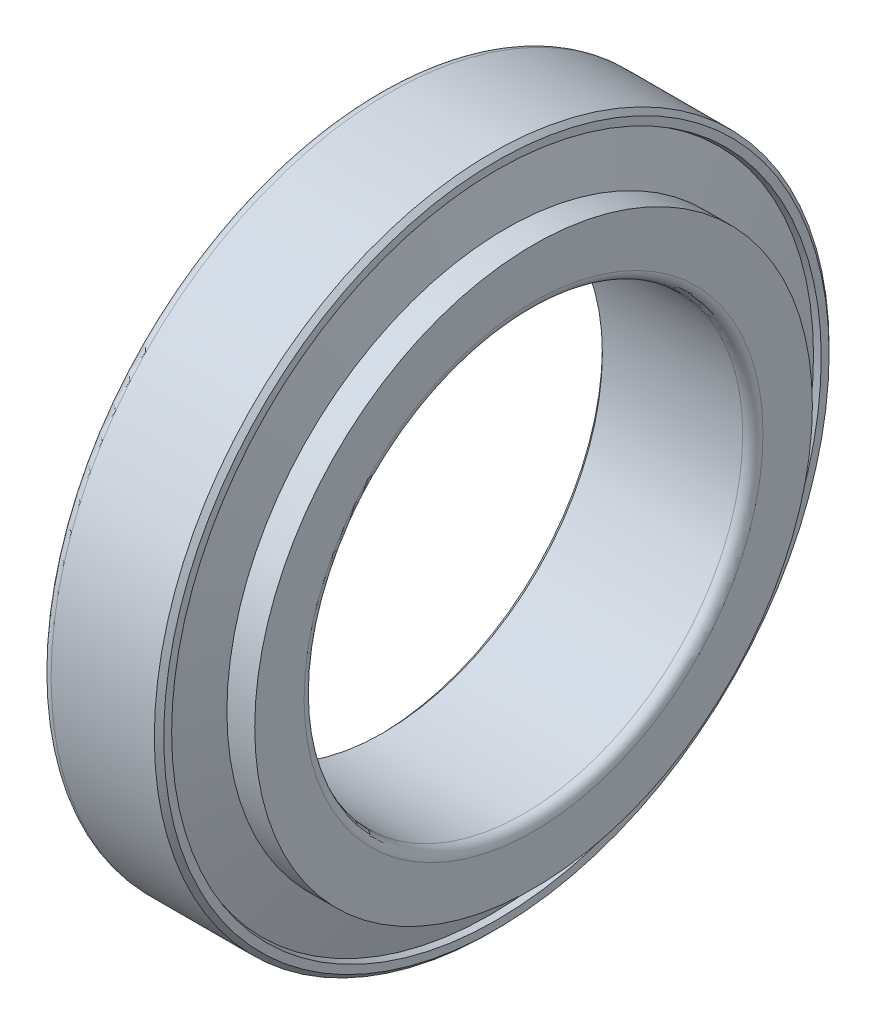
ISO-10303-21;
HEADER;
FILE_DESCRIPTION(('STEP AP214'),'2;1');
FILE_NAME('part.step','',(''),(''),'','','');
FILE_SCHEMA(('AUTOMOTIVE_DESIGN { 1 0 10303 214 1 1 1 1 }'));
ENDSEC;
DATA;
#1=APPLICATION_CONTEXT('core data for automotive mechanical design processes');
#2=APPLICATION_PROTOCOL_DEFINITION('international standard','automotive_design',2000,#1);
#3=PRODUCT_CONTEXT('',#1,'mechanical');
#4=PRODUCT('Part','Part','',(#3));
#5=PRODUCT_RELATED_PRODUCT_CATEGORY('part','',(#4));
#6=PRODUCT_DEFINITION_FORMATION('','',#4);
#7=PRODUCT_DEFINITION_CONTEXT('part definition',#1,'design');
#8=PRODUCT_DEFINITION('design','',#6,#7);
#9=PRODUCT_DEFINITION_SHAPE('','',#8);
#10=(LENGTH_UNIT() NAMED_UNIT(*) SI_UNIT(.MILLI.,.METRE.));
#11=(NAMED_UNIT(*) PLANE_ANGLE_UNIT() SI_UNIT($,.RADIAN.));
#12=(NAMED_UNIT(*) SI_UNIT($,.STERADIAN.) SOLID_ANGLE_UNIT());
#13=UNCERTAINTY_MEASURE_WITH_UNIT(LENGTH_MEASURE(1.E-05),#10,'distance_accuracy_value','');
#14=(GEOMETRIC_REPRESENTATION_CONTEXT(3) GLOBAL_UNCERTAINTY_ASSIGNED_CONTEXT((#13)) GLOBAL_UNIT_ASSIGNED_CONTEXT((#10,
#11,#12)) REPRESENTATION_CONTEXT('',''));
#15=CARTESIAN_POINT('',(0.,0.,0.));
#16=DIRECTION('',(0.,0.,1.));
#17=DIRECTION('',(1.,0.,0.));
#18=AXIS2_PLACEMENT_3D('',#15,#16,#17);
#19=CARTESIAN_POINT('',(-23.,0.,0.));
#20=DIRECTION('',(1.,0.,0.));
#21=DIRECTION('',(0.,0.,-1.));
#22=AXIS2_PLACEMENT_3D('',#19,#20,#21);
#23=CONICAL_SURFACE('',#22,42.7835,0.296705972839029);
#24=CARTESIAN_POINT('',(-21.4395483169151,0.,0.));
#25=DIRECTION('',(-1.,0.,0.));
#26=DIRECTION('',(0.,0.,1.));
#27=AXIS2_PLACEMENT_3D('',#24,#25,#26);
#28=CIRCLE('',#27,43.2605779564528);
#29=CARTESIAN_POINT('',(-21.4395483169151,0.,43.2605779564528));
#30=VERTEX_POINT('',#29);
#31=EDGE_CURVE('E42',#30,#30,#28,.T.);
#32=ORIENTED_EDGE('',*,*,#31,.F.);
#33=EDGE_LOOP('',(#32));
#34=FACE_BOUND('',#33,.T.);
#35=CARTESIAN_POINT('',(-23.,0.,0.));
#36=DIRECTION('',(1.,0.,0.));
#37=DIRECTION('',(0.,0.,-1.));
#38=AXIS2_PLACEMENT_3D('',#35,#36,#37);
#39=CIRCLE('',#38,42.7835);
#40=CARTESIAN_POINT('',(-23.,0.,-42.7835));
#41=VERTEX_POINT('',#40);
#42=EDGE_CURVE('E54',#41,#41,#39,.T.);
#43=ORIENTED_EDGE('',*,*,#42,.F.);
#44=EDGE_LOOP('',(#43));
#45=FACE_BOUND('',#44,.T.);
#46=ADVANCED_FACE('F31',(#34,#45),#23,.F.);
#47=CARTESIAN_POINT('',(-5.5,49.3,0.));
#48=DIRECTION('',(1.,0.,0.));
#49=DIRECTION('',(0.,0.,-1.));
#50=AXIS2_PLACEMENT_3D('',#47,#48,#49);
#51=PLANE('',#50);
#52=CARTESIAN_POINT('',(-5.5,0.,0.));
#53=DIRECTION('',(1.,0.,0.));
#54=DIRECTION('',(0.,0.,-1.));
#55=AXIS2_PLACEMENT_3D('',#52,#53,#54);
#56=CIRCLE('',#55,49.3);
#57=CARTESIAN_POINT('',(-5.5,0.,-49.3));
#58=VERTEX_POINT('',#57);
#59=EDGE_CURVE('E66',#58,#58,#56,.T.);
#60=ORIENTED_EDGE('',*,*,#59,.T.);
#61=EDGE_LOOP('',(#60));
#62=FACE_BOUND('',#61,.T.);
#63=CARTESIAN_POINT('',(-5.5,0.,0.));
#64=DIRECTION('',(1.,0.,0.));
#65=DIRECTION('',(0.,0.,-1.));
#66=AXIS2_PLACEMENT_3D('',#63,#64,#65);
#67=CIRCLE('',#66,48.1337869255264);
#68=CARTESIAN_POINT('',(-5.5,0.,-48.1337869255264));
#69=VERTEX_POINT('',#68);
#70=EDGE_CURVE('E51',#69,#69,#67,.T.);
#71=ORIENTED_EDGE('',*,*,#70,.F.);
#72=EDGE_LOOP('',(#71));
#73=FACE_BOUND('',#72,.T.);
#74=ADVANCED_FACE('F33',(#62,#73),#51,.T.);
#75=CARTESIAN_POINT('',(-6.37774841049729,0.,0.));
#76=DIRECTION('',(-1.,0.,0.));
#77=DIRECTION('',(0.,0.,1.));
#78=AXIS2_PLACEMENT_3D('',#75,#76,#77);
#79=CIRCLE('',#78,47.8654323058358);
#80=CARTESIAN_POINT('',(-6.37774841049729,0.,47.8654323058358));
#81=VERTEX_POINT('',#80);
#82=EDGE_CURVE('E46',#81,#81,#79,.F.);
#83=ORIENTED_EDGE('',*,*,#82,.F.);
#84=EDGE_LOOP('',(#83));
#85=FACE_BOUND('',#84,.T.);
#86=ORIENTED_EDGE('',*,*,#70,.T.);
#87=EDGE_LOOP('',(#86));
#88=FACE_BOUND('',#87,.T.);
#89=ADVANCED_FACE('F119',(#85,#88),#23,.F.);
#90=CARTESIAN_POINT('',(-23.,42.7835,0.));
#91=DIRECTION('',(-1.,0.,0.));
#92=DIRECTION('',(0.,0.,1.));
#93=AXIS2_PLACEMENT_3D('',#90,#91,#92);
#94=PLANE('',#93);
#95=ORIENTED_EDGE('',*,*,#42,.T.);
#96=EDGE_LOOP('',(#95));
#97=FACE_BOUND('',#96,.T.);
#98=CARTESIAN_POINT('',(-23.,0.,0.));
#99=DIRECTION('',(1.,0.,0.));
#100=DIRECTION('',(0.,0.,-1.));
#101=AXIS2_PLACEMENT_3D('',#98,#99,#100);
#102=CIRCLE('',#101,48.5);
#103=CARTESIAN_POINT('',(-23.,0.,-48.5));
#104=VERTEX_POINT('',#103);
#105=EDGE_CURVE('E57',#104,#104,#102,.T.);
#106=ORIENTED_EDGE('',*,*,#105,.F.);
#107=EDGE_LOOP('',(#106));
#108=FACE_BOUND('',#107,.T.);
#109=ADVANCED_FACE('F128',(#97,#108),#94,.T.);
#110=CARTESIAN_POINT('',(-21.5,0.,0.));
#111=DIRECTION('',(1.,0.,0.));
#112=DIRECTION('',(0.,0.,-1.));
#113=AXIS2_PLACEMENT_3D('',#110,#111,#112);
#114=TOROIDAL_SURFACE('',#113,48.5,1.5);
#115=ORIENTED_EDGE('',*,*,#105,.T.);
#116=EDGE_LOOP('',(#115));
#117=FACE_BOUND('',#116,.T.);
#118=CARTESIAN_POINT('',(-21.5,0.,0.));
#119=DIRECTION('',(1.,0.,0.));
#120=DIRECTION('',(0.,0.,-1.));
#121=AXIS2_PLACEMENT_3D('',#118,#119,#120);
#122=CIRCLE('',#121,50.);
#123=CARTESIAN_POINT('',(-21.5,0.,-50.));
#124=VERTEX_POINT('',#123);
#125=EDGE_CURVE('E60',#124,#124,#122,.T.);
#126=ORIENTED_EDGE('',*,*,#125,.F.);
#127=EDGE_LOOP('',(#126));
#128=FACE_BOUND('',#127,.T.);
#129=ADVANCED_FACE('F133',(#117,#128),#114,.T.);
#130=CARTESIAN_POINT('',(-42.5,0.,0.));
#131=DIRECTION('',(1.,0.,0.));
#132=DIRECTION('',(0.,0.,-1.));
#133=AXIS2_PLACEMENT_3D('',#130,#131,#132);
#134=CYLINDRICAL_SURFACE('',#133,50.);
#135=ORIENTED_EDGE('',*,*,#125,.T.);
#136=EDGE_LOOP('',(#135));
#137=FACE_BOUND('',#136,.T.);
#138=CARTESIAN_POINT('',(-6.2,0.,0.));
#139=DIRECTION('',(1.,0.,0.));
#140=DIRECTION('',(0.,0.,-1.));
#141=AXIS2_PLACEMENT_3D('',#138,#139,#140);
#142=CIRCLE('',#141,50.);
#143=CARTESIAN_POINT('',(-6.2,0.,-50.));
#144=VERTEX_POINT('',#143);
#145=EDGE_CURVE('E63',#144,#144,#142,.T.);
#146=ORIENTED_EDGE('',*,*,#145,.F.);
#147=EDGE_LOOP('',(#146));
#148=FACE_BOUND('',#147,.T.);
#149=ADVANCED_FACE('F155',(#137,#148),#134,.T.);
#150=CARTESIAN_POINT('',(-5.5,0.,0.));
#151=DIRECTION('',(-1.,0.,0.));
#152=DIRECTION('',(0.,0.,1.));
#153=AXIS2_PLACEMENT_3D('',#150,#151,#152);
#154=CONICAL_SURFACE('',#153,49.3,0.785398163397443);
#155=ORIENTED_EDGE('',*,*,#145,.T.);
#156=EDGE_LOOP('',(#155));
#157=FACE_BOUND('',#156,.T.);
#158=ORIENTED_EDGE('',*,*,#59,.F.);
#159=EDGE_LOOP('',(#158));
#160=FACE_BOUND('',#159,.T.);
#161=ADVANCED_FACE('F149',(#157,#160),#154,.T.);
#162=CARTESIAN_POINT('',(-21.5,0.,0.));
#163=DIRECTION('',(-1.,0.,0.));
#164=DIRECTION('',(0.,0.,1.));
#165=AXIS2_PLACEMENT_3D('',#162,#163,#164);
#166=CONICAL_SURFACE('',#165,43.4583065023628,1.27409035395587);
#167=CARTESIAN_POINT('',(-19.3179542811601,0.,0.));
#168=DIRECTION('',(-1.,0.,0.));
#169=DIRECTION('',(0.,0.,1.));
#170=AXIS2_PLACEMENT_3D('',#167,#168,#169);
#171=CIRCLE('',#170,36.3211565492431);
#172=CARTESIAN_POINT('',(-19.3179542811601,0.,36.3211565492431));
#173=VERTEX_POINT('',#172);
#174=EDGE_CURVE('E10',#173,#173,#171,.T.);
#175=ORIENTED_EDGE('',*,*,#174,.F.);
#176=EDGE_LOOP('',(#175));
#177=FACE_BOUND('',#176,.T.);
#178=ORIENTED_EDGE('',*,*,#31,.T.);
#179=EDGE_LOOP('',(#178));
#180=FACE_BOUND('',#179,.T.);
#181=ADVANCED_FACE('F143',(#177,#180),#166,.F.);
#182=CARTESIAN_POINT('',(-19.1975728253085,0.,0.));
#183=DIRECTION('',(1.,0.,0.));
#184=DIRECTION('',(0.,0.,-1.));
#185=AXIS2_PLACEMENT_3D('',#182,#183,#184);
#186=CONICAL_SURFACE('',#185,35.9274065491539,0.296705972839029);
#187=CARTESIAN_POINT('',(-19.1870447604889,0.,0.));
#188=DIRECTION('',(-1.,0.,0.));
#189=DIRECTION('',(0.,0.,1.));
#190=AXIS2_PLACEMENT_3D('',#187,#188,#189);
#191=CIRCLE('',#190,35.9306253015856);
#192=CARTESIAN_POINT('',(-19.1870447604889,0.,35.9306253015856));
#193=VERTEX_POINT('',#192);
#194=EDGE_CURVE('E38',#193,#193,#191,.F.);
#195=ORIENTED_EDGE('',*,*,#194,.F.);
#196=EDGE_LOOP('',(#195));
#197=FACE_BOUND('',#196,.T.);
#198=CARTESIAN_POINT('',(-4.13577291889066,0.,0.));
#199=DIRECTION('',(1.,0.,0.));
#200=DIRECTION('',(0.,0.,-1.));
#201=AXIS2_PLACEMENT_3D('',#198,#199,#200);
#202=CIRCLE('',#201,40.5322608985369);
#203=CARTESIAN_POINT('',(-4.13577291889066,0.,-40.5322608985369));
#204=VERTEX_POINT('',#203);
#205=EDGE_CURVE('E69',#204,#204,#202,.T.);
#206=ORIENTED_EDGE('',*,*,#205,.T.);
#207=EDGE_LOOP('',(#206));
#208=FACE_BOUND('',#207,.T.);
#209=ADVANCED_FACE('F114',(#197,#208),#186,.F.);
#210=CARTESIAN_POINT('',(-4.13577291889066,0.,0.));
#211=DIRECTION('',(-1.,0.,0.));
#212=DIRECTION('',(0.,0.,1.));
#213=AXIS2_PLACEMENT_3D('',#210,#211,#212);
#214=CONICAL_SURFACE('',#213,40.5322608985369,1.27409035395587);
#215=ORIENTED_EDGE('',*,*,#82,.T.);
#216=EDGE_LOOP('',(#215));
#217=FACE_BOUND('',#216,.T.);
#218=ORIENTED_EDGE('',*,*,#205,.F.);
#219=EDGE_LOOP('',(#218));
#220=FACE_BOUND('',#219,.T.);
#221=ADVANCED_FACE('F106',(#217,#220),#214,.T.);
#222=CARTESIAN_POINT('',(-19.1860606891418,0.,0.));
#223=DIRECTION('',(-1.,0.,0.));
#224=DIRECTION('',(0.,0.,1.));
#225=AXIS2_PLACEMENT_3D('',#222,#223,#224);
#226=CONICAL_SURFACE('',#225,35.9274065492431,1.27409035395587);
#227=ORIENTED_EDGE('',*,*,#194,.T.);
#228=EDGE_LOOP('',(#227));
#229=FACE_BOUND('',#228,.T.);
#230=CARTESIAN_POINT('',(-19.1860606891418,0.,0.));
#231=DIRECTION('',(1.,0.,0.));
#232=DIRECTION('',(0.,0.,-1.));
#233=AXIS2_PLACEMENT_3D('',#230,#231,#232);
#234=CIRCLE('',#233,35.9274065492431);
#235=CARTESIAN_POINT('',(-19.1860606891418,0.,-35.9274065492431));
#236=VERTEX_POINT('',#235);
#237=EDGE_CURVE('E96',#236,#236,#234,.T.);
#238=ORIENTED_EDGE('',*,*,#237,.F.);
#239=EDGE_LOOP('',(#238));
#240=FACE_BOUND('',#239,.T.);
#241=ADVANCED_FACE('F103',(#229,#240),#226,.T.);
#242=CARTESIAN_POINT('',(-42.5,0.,0.));
#243=DIRECTION('',(1.,0.,0.));
#244=DIRECTION('',(0.,0.,-1.));
#245=AXIS2_PLACEMENT_3D('',#242,#243,#244);
#246=CYLINDRICAL_SURFACE('',#245,36.3211565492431);
#247=ORIENTED_EDGE('',*,*,#174,.T.);
#248=EDGE_LOOP('',(#247));
#249=FACE_BOUND('',#248,.T.);
#250=CARTESIAN_POINT('',(-23.,0.,0.));
#251=DIRECTION('',(1.,0.,0.));
#252=DIRECTION('',(0.,0.,-1.));
#253=AXIS2_PLACEMENT_3D('',#250,#251,#252);
#254=CIRCLE('',#253,36.3211565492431);
#255=CARTESIAN_POINT('',(-23.,0.,-36.3211565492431));
#256=VERTEX_POINT('',#255);
#257=EDGE_CURVE('E72',#256,#256,#254,.T.);
#258=ORIENTED_EDGE('',*,*,#257,.T.);
#259=EDGE_LOOP('',(#258));
#260=FACE_BOUND('',#259,.T.);
#261=ADVANCED_FACE('F105',(#249,#260),#246,.T.);
#262=CARTESIAN_POINT('',(-23.,36.3211565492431,0.));
#263=DIRECTION('',(-1.,0.,0.));
#264=DIRECTION('',(0.,0.,1.));
#265=AXIS2_PLACEMENT_3D('',#262,#263,#264);
#266=PLANE('',#265);
#267=CARTESIAN_POINT('',(-23.,0.,0.));
#268=DIRECTION('',(1.,0.,0.));
#269=DIRECTION('',(0.,0.,-1.));
#270=AXIS2_PLACEMENT_3D('',#267,#268,#269);
#271=CIRCLE('',#270,33.2);
#272=CARTESIAN_POINT('',(-23.,0.,-33.2));
#273=VERTEX_POINT('',#272);
#274=EDGE_CURVE('E75',#273,#273,#271,.T.);
#275=ORIENTED_EDGE('',*,*,#274,.T.);
#276=EDGE_LOOP('',(#275));
#277=FACE_BOUND('',#276,.T.);
#278=ORIENTED_EDGE('',*,*,#257,.F.);
#279=EDGE_LOOP('',(#278));
#280=FACE_BOUND('',#279,.T.);
#281=ADVANCED_FACE('F112',(#277,#280),#266,.T.);
#282=CARTESIAN_POINT('',(-23.,0.,0.));
#283=DIRECTION('',(-1.,0.,0.));
#284=DIRECTION('',(0.,0.,1.));
#285=AXIS2_PLACEMENT_3D('',#282,#283,#284);
#286=CONICAL_SURFACE('',#285,33.2,0.785398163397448);
#287=CARTESIAN_POINT('',(-22.3,0.,0.));
#288=DIRECTION('',(1.,0.,0.));
#289=DIRECTION('',(0.,0.,-1.));
#290=AXIS2_PLACEMENT_3D('',#287,#288,#289);
#291=CIRCLE('',#290,32.5);
#292=CARTESIAN_POINT('',(-22.3,0.,-32.5));
#293=VERTEX_POINT('',#292);
#294=EDGE_CURVE('E78',#293,#293,#291,.T.);
#295=ORIENTED_EDGE('',*,*,#294,.T.);
#296=EDGE_LOOP('',(#295));
#297=FACE_BOUND('',#296,.T.);
#298=ORIENTED_EDGE('',*,*,#274,.F.);
#299=EDGE_LOOP('',(#298));
#300=FACE_BOUND('',#299,.T.);
#301=ADVANCED_FACE('F213',(#297,#300),#286,.F.);
#302=CARTESIAN_POINT('',(-42.5,0.,0.));
#303=DIRECTION('',(1.,0.,0.));
#304=DIRECTION('',(0.,0.,-1.));
#305=AXIS2_PLACEMENT_3D('',#302,#303,#304);
#306=CYLINDRICAL_SURFACE('',#305,32.5);
#307=CARTESIAN_POINT('',(-1.5,0.,0.));
#308=DIRECTION('',(1.,0.,0.));
#309=DIRECTION('',(0.,0.,-1.));
#310=AXIS2_PLACEMENT_3D('',#307,#308,#309);
#311=CIRCLE('',#310,32.5);
#312=CARTESIAN_POINT('',(-1.5,0.,-32.5));
#313=VERTEX_POINT('',#312);
#314=EDGE_CURVE('E81',#313,#313,#311,.T.);
#315=ORIENTED_EDGE('',*,*,#314,.T.);
#316=EDGE_LOOP('',(#315));
#317=FACE_BOUND('',#316,.T.);
#318=ORIENTED_EDGE('',*,*,#294,.F.);
#319=EDGE_LOOP('',(#318));
#320=FACE_BOUND('',#319,.T.);
#321=ADVANCED_FACE('F223',(#317,#320),#306,.F.);
#322=CARTESIAN_POINT('',(-1.5,0.,0.));
#323=DIRECTION('',(1.,0.,0.));
#324=DIRECTION('',(0.,0.,-1.));
#325=AXIS2_PLACEMENT_3D('',#322,#323,#324);
#326=TOROIDAL_SURFACE('',#325,34.,1.5);
#327=CARTESIAN_POINT('',(0.,0.,0.));
#328=DIRECTION('',(1.,0.,0.));
#329=DIRECTION('',(0.,0.,-1.));
#330=AXIS2_PLACEMENT_3D('',#327,#328,#329);
#331=CIRCLE('',#330,34.);
#332=CARTESIAN_POINT('',(0.,0.,-34.));
#333=VERTEX_POINT('',#332);
#334=EDGE_CURVE('E84',#333,#333,#331,.T.);
#335=ORIENTED_EDGE('',*,*,#334,.T.);
#336=EDGE_LOOP('',(#335));
#337=FACE_BOUND('',#336,.T.);
#338=ORIENTED_EDGE('',*,*,#314,.F.);
#339=EDGE_LOOP('',(#338));
#340=FACE_BOUND('',#339,.T.);
#341=ADVANCED_FACE('F233',(#337,#340),#326,.T.);
#342=CARTESIAN_POINT('',(0.,34.,0.));
#343=DIRECTION('',(1.,0.,0.));
#344=DIRECTION('',(0.,0.,-1.));
#345=AXIS2_PLACEMENT_3D('',#342,#343,#344);
#346=PLANE('',#345);
#347=CARTESIAN_POINT('',(0.,0.,0.));
#348=DIRECTION('',(1.,0.,0.));
#349=DIRECTION('',(0.,0.,-1.));
#350=AXIS2_PLACEMENT_3D('',#347,#348,#349);
#351=CIRCLE('',#350,41.3197608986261);
#352=CARTESIAN_POINT('',(0.,0.,-41.3197608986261));
#353=VERTEX_POINT('',#352);
#354=EDGE_CURVE('E87',#353,#353,#351,.T.);
#355=ORIENTED_EDGE('',*,*,#354,.T.);
#356=EDGE_LOOP('',(#355));
#357=FACE_BOUND('',#356,.T.);
#358=ORIENTED_EDGE('',*,*,#334,.F.);
#359=EDGE_LOOP('',(#358));
#360=FACE_BOUND('',#359,.T.);
#361=ADVANCED_FACE('F243',(#357,#360),#346,.T.);
#362=CARTESIAN_POINT('',(-42.5,0.,0.));
#363=DIRECTION('',(1.,0.,0.));
#364=DIRECTION('',(0.,0.,-1.));
#365=AXIS2_PLACEMENT_3D('',#362,#363,#364);
#366=CYLINDRICAL_SURFACE('',#365,41.3197608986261);
#367=CARTESIAN_POINT('',(-4.12426078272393,0.,0.));
#368=DIRECTION('',(1.,0.,0.));
#369=DIRECTION('',(0.,0.,-1.));
#370=AXIS2_PLACEMENT_3D('',#367,#368,#369);
#371=CIRCLE('',#370,41.3197608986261);
#372=CARTESIAN_POINT('',(-4.12426078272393,0.,-41.3197608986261));
#373=VERTEX_POINT('',#372);
#374=EDGE_CURVE('E90',#373,#373,#371,.T.);
#375=ORIENTED_EDGE('',*,*,#374,.T.);
#376=EDGE_LOOP('',(#375));
#377=FACE_BOUND('',#376,.T.);
#378=ORIENTED_EDGE('',*,*,#354,.F.);
#379=EDGE_LOOP('',(#378));
#380=FACE_BOUND('',#379,.T.);
#381=ADVANCED_FACE('F253',(#377,#380),#366,.T.);
#382=CARTESIAN_POINT('',(-4.12426078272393,41.3197608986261,0.));
#383=DIRECTION('',(-1.,0.,0.));
#384=DIRECTION('',(0.,0.,1.));
#385=AXIS2_PLACEMENT_3D('',#382,#383,#384);
#386=PLANE('',#385);
#387=CARTESIAN_POINT('',(-4.12426078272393,0.,0.));
#388=DIRECTION('',(1.,0.,0.));
#389=DIRECTION('',(0.,0.,-1.));
#390=AXIS2_PLACEMENT_3D('',#387,#388,#389);
#391=CIRCLE('',#390,40.5322608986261);
#392=CARTESIAN_POINT('',(-4.12426078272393,0.,-40.5322608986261));
#393=VERTEX_POINT('',#392);
#394=EDGE_CURVE('E93',#393,#393,#391,.T.);
#395=ORIENTED_EDGE('',*,*,#394,.T.);
#396=EDGE_LOOP('',(#395));
#397=FACE_BOUND('',#396,.T.);
#398=ORIENTED_EDGE('',*,*,#374,.F.);
#399=EDGE_LOOP('',(#398));
#400=FACE_BOUND('',#399,.T.);
#401=ADVANCED_FACE('F263',(#397,#400),#386,.T.);
#402=CARTESIAN_POINT('',(-4.12426078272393,0.,0.));
#403=DIRECTION('',(1.,0.,0.));
#404=DIRECTION('',(0.,0.,-1.));
#405=AXIS2_PLACEMENT_3D('',#402,#403,#404);
#406=CONICAL_SURFACE('',#405,40.5322608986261,0.296705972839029);
#407=ORIENTED_EDGE('',*,*,#237,.T.);
#408=EDGE_LOOP('',(#407));
#409=FACE_BOUND('',#408,.T.);
#410=ORIENTED_EDGE('',*,*,#394,.F.);
#411=EDGE_LOOP('',(#410));
#412=FACE_BOUND('',#411,.T.);
#413=ADVANCED_FACE('F100',(#409,#412),#406,.T.);
#414=CLOSED_SHELL('',(#46,#74,#89,#109,#129,#149,#161,#181,#209,#221,#241,#261,#281,#301,#321,
#341,#361,#381,#401,#413));
#415=MANIFOLD_SOLID_BREP('B2',#414);
#416=ADVANCED_BREP_SHAPE_REPRESENTATION('',(#18,#415),#14);
#417=SHAPE_DEFINITION_REPRESENTATION(#9,#416);
ENDSEC;
END-ISO-10303-21;
